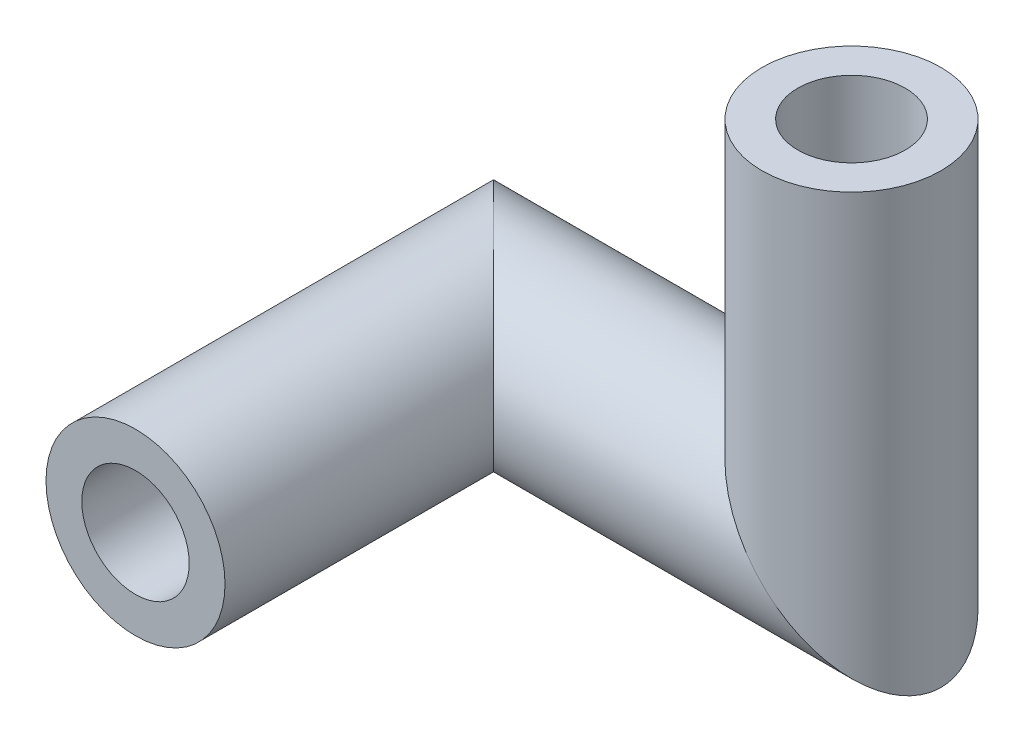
ISO-10303-21;
HEADER;
FILE_DESCRIPTION(('STEP AP214'),'2;1');
FILE_NAME('part.step','',(''),(''),'','','');
FILE_SCHEMA(('AUTOMOTIVE_DESIGN { 1 0 10303 214 1 1 1 1 }'));
ENDSEC;
DATA;
#1=APPLICATION_CONTEXT('core data for automotive mechanical design processes');
#2=APPLICATION_PROTOCOL_DEFINITION('international standard','automotive_design',2000,#1);
#3=PRODUCT_CONTEXT('',#1,'mechanical');
#4=PRODUCT('Part','Part','',(#3));
#5=PRODUCT_RELATED_PRODUCT_CATEGORY('part','',(#4));
#6=PRODUCT_DEFINITION_FORMATION('','',#4);
#7=PRODUCT_DEFINITION_CONTEXT('part definition',#1,'design');
#8=PRODUCT_DEFINITION('design','',#6,#7);
#9=PRODUCT_DEFINITION_SHAPE('','',#8);
#10=(LENGTH_UNIT() NAMED_UNIT(*) SI_UNIT(.MILLI.,.METRE.));
#11=(NAMED_UNIT(*) PLANE_ANGLE_UNIT() SI_UNIT($,.RADIAN.));
#12=(NAMED_UNIT(*) SI_UNIT($,.STERADIAN.) SOLID_ANGLE_UNIT());
#13=UNCERTAINTY_MEASURE_WITH_UNIT(LENGTH_MEASURE(1.E-05),#10,'distance_accuracy_value','');
#14=(GEOMETRIC_REPRESENTATION_CONTEXT(3) GLOBAL_UNCERTAINTY_ASSIGNED_CONTEXT((#13)) GLOBAL_UNIT_ASSIGNED_CONTEXT((#10,
#11,#12)) REPRESENTATION_CONTEXT('',''));
#15=CARTESIAN_POINT('',(0.,0.,0.));
#16=DIRECTION('',(0.,0.,1.));
#17=DIRECTION('',(1.,0.,0.));
#18=AXIS2_PLACEMENT_3D('',#15,#16,#17);
#19=CARTESIAN_POINT('',(10.,9.99999999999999,-10.));
#20=DIRECTION('',(0.,-1.,0.));
#21=DIRECTION('',(0.,0.,-1.));
#22=AXIS2_PLACEMENT_3D('',#19,#20,#21);
#23=PLANE('',#22);
#24=CARTESIAN_POINT('',(10.,9.99999999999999,-10.));
#25=DIRECTION('',(0.,-1.,0.));
#26=DIRECTION('',(0.,0.,-1.));
#27=AXIS2_PLACEMENT_3D('',#24,#25,#26);
#28=CIRCLE('',#27,1.5);
#29=CARTESIAN_POINT('',(10.,9.99999999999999,-11.5));
#30=VERTEX_POINT('',#29);
#31=EDGE_CURVE('E72',#30,#30,#28,.T.);
#32=ORIENTED_EDGE('',*,*,#31,.T.);
#33=EDGE_LOOP('',(#32));
#34=FACE_BOUND('',#33,.T.);
#35=CARTESIAN_POINT('',(10.,9.99999999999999,-10.));
#36=DIRECTION('',(0.,-1.,0.));
#37=DIRECTION('',(0.,0.,-1.));
#38=AXIS2_PLACEMENT_3D('',#35,#36,#37);
#39=CIRCLE('',#38,2.5);
#40=CARTESIAN_POINT('',(10.,9.99999999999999,-12.5));
#41=VERTEX_POINT('',#40);
#42=EDGE_CURVE('E44',#41,#41,#39,.T.);
#43=ORIENTED_EDGE('',*,*,#42,.F.);
#44=EDGE_LOOP('',(#43));
#45=FACE_BOUND('',#44,.T.);
#46=ADVANCED_FACE('F41',(#34,#45),#23,.F.);
#47=CARTESIAN_POINT('',(0.,0.,0.));
#48=DIRECTION('',(0.,0.,1.));
#49=DIRECTION('',(-1.,0.,0.));
#50=AXIS2_PLACEMENT_3D('',#47,#48,#49);
#51=PLANE('',#50);
#52=CARTESIAN_POINT('',(0.,0.,0.));
#53=DIRECTION('',(0.,0.,1.));
#54=DIRECTION('',(0.,-1.,0.));
#55=AXIS2_PLACEMENT_3D('',#52,#53,#54);
#56=CIRCLE('',#55,1.5);
#57=CARTESIAN_POINT('',(0.,-1.5,0.));
#58=VERTEX_POINT('',#57);
#59=EDGE_CURVE('E64',#58,#58,#56,.T.);
#60=ORIENTED_EDGE('',*,*,#59,.F.);
#61=EDGE_LOOP('',(#60));
#62=FACE_BOUND('',#61,.T.);
#63=CARTESIAN_POINT('',(0.,0.,0.));
#64=DIRECTION('',(0.,0.,1.));
#65=DIRECTION('',(-1.,0.,0.));
#66=AXIS2_PLACEMENT_3D('',#63,#64,#65);
#67=CIRCLE('',#66,2.5);
#68=CARTESIAN_POINT('',(-2.5,0.,0.));
#69=VERTEX_POINT('',#68);
#70=EDGE_CURVE('E48',#69,#69,#67,.T.);
#71=ORIENTED_EDGE('',*,*,#70,.T.);
#72=EDGE_LOOP('',(#71));
#73=FACE_BOUND('',#72,.T.);
#74=ADVANCED_FACE('F104',(#62,#73),#51,.T.);
#75=CARTESIAN_POINT('',(9.99999999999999,-5.6,-10.));
#76=DIRECTION('',(0.,1.,0.));
#77=DIRECTION('',(0.,0.,1.));
#78=AXIS2_PLACEMENT_3D('',#75,#76,#77);
#79=CYLINDRICAL_SURFACE('',#78,2.5);
#80=CARTESIAN_POINT('',(10.,0.,-10.));
#81=DIRECTION('',(0.707106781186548,0.707106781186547,0.));
#82=DIRECTION('',(0.707106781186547,-0.707106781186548,0.));
#83=AXIS2_PLACEMENT_3D('',#80,#81,#82);
#84=ELLIPSE('',#83,3.53553390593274,2.5);
#85=CARTESIAN_POINT('',(12.5,-2.5,-10.));
#86=VERTEX_POINT('',#85);
#87=EDGE_CURVE('E53',#86,#86,#84,.T.);
#88=ORIENTED_EDGE('',*,*,#87,.T.);
#89=EDGE_LOOP('',(#88));
#90=FACE_BOUND('',#89,.T.);
#91=ORIENTED_EDGE('',*,*,#42,.T.);
#92=EDGE_LOOP('',(#91));
#93=FACE_BOUND('',#92,.T.);
#94=ADVANCED_FACE('F102',(#90,#93),#79,.T.);
#95=CARTESIAN_POINT('',(-2.85,0.,-9.99999999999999));
#96=DIRECTION('',(1.,0.,0.));
#97=DIRECTION('',(0.,0.,-1.));
#98=AXIS2_PLACEMENT_3D('',#95,#96,#97);
#99=CYLINDRICAL_SURFACE('',#98,2.5);
#100=CARTESIAN_POINT('',(0.,0.,-9.99999999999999));
#101=DIRECTION('',(0.707106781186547,0.,-0.707106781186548));
#102=DIRECTION('',(-0.707106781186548,0.,-0.707106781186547));
#103=AXIS2_PLACEMENT_3D('',#100,#101,#102);
#104=ELLIPSE('',#103,3.53553390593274,2.5);
#105=CARTESIAN_POINT('',(-2.5,0.,-12.5));
#106=VERTEX_POINT('',#105);
#107=EDGE_CURVE('E11',#106,#106,#104,.T.);
#108=ORIENTED_EDGE('',*,*,#107,.T.);
#109=EDGE_LOOP('',(#108));
#110=FACE_BOUND('',#109,.T.);
#111=ORIENTED_EDGE('',*,*,#87,.F.);
#112=EDGE_LOOP('',(#111));
#113=FACE_BOUND('',#112,.T.);
#114=ADVANCED_FACE('F93',(#110,#113),#99,.T.);
#115=CARTESIAN_POINT('',(0.,0.,0.));
#116=DIRECTION('',(0.,0.,-1.));
#117=DIRECTION('',(-1.,0.,0.));
#118=AXIS2_PLACEMENT_3D('',#115,#116,#117);
#119=CYLINDRICAL_SURFACE('',#118,2.5);
#120=ORIENTED_EDGE('',*,*,#70,.F.);
#121=EDGE_LOOP('',(#120));
#122=FACE_BOUND('',#121,.T.);
#123=ORIENTED_EDGE('',*,*,#107,.F.);
#124=EDGE_LOOP('',(#123));
#125=FACE_BOUND('',#124,.T.);
#126=ADVANCED_FACE('F84',(#122,#125),#119,.T.);
#127=CARTESIAN_POINT('',(9.99999999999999,-5.6,-10.));
#128=DIRECTION('',(0.,1.,0.));
#129=DIRECTION('',(0.,0.,1.));
#130=AXIS2_PLACEMENT_3D('',#127,#128,#129);
#131=CYLINDRICAL_SURFACE('',#130,1.5);
#132=CARTESIAN_POINT('',(9.99999999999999,0.,-10.));
#133=DIRECTION('',(0.707106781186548,0.707106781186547,0.));
#134=DIRECTION('',(-0.707106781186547,0.707106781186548,0.));
#135=AXIS2_PLACEMENT_3D('',#132,#133,#134);
#136=ELLIPSE('',#135,2.12132034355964,1.5);
#137=CARTESIAN_POINT('',(8.49999999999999,1.5,-10.));
#138=VERTEX_POINT('',#137);
#139=EDGE_CURVE('E69',#138,#138,#136,.T.);
#140=ORIENTED_EDGE('',*,*,#139,.F.);
#141=EDGE_LOOP('',(#140));
#142=FACE_BOUND('',#141,.T.);
#143=ORIENTED_EDGE('',*,*,#31,.F.);
#144=EDGE_LOOP('',(#143));
#145=FACE_BOUND('',#144,.T.);
#146=ADVANCED_FACE('F81',(#142,#145),#131,.F.);
#147=CARTESIAN_POINT('',(-2.85,0.,-9.99999999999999));
#148=DIRECTION('',(1.,0.,0.));
#149=DIRECTION('',(0.,0.,-1.));
#150=AXIS2_PLACEMENT_3D('',#147,#148,#149);
#151=CYLINDRICAL_SURFACE('',#150,1.5);
#152=CARTESIAN_POINT('',(0.,0.,-9.99999999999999));
#153=DIRECTION('',(0.707106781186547,0.,-0.707106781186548));
#154=DIRECTION('',(0.707106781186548,0.,0.707106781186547));
#155=AXIS2_PLACEMENT_3D('',#152,#153,#154);
#156=ELLIPSE('',#155,2.12132034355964,1.5);
#157=CARTESIAN_POINT('',(1.5,0.,-8.49999999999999));
#158=VERTEX_POINT('',#157);
#159=EDGE_CURVE('E60',#158,#158,#156,.T.);
#160=ORIENTED_EDGE('',*,*,#159,.F.);
#161=EDGE_LOOP('',(#160));
#162=FACE_BOUND('',#161,.T.);
#163=ORIENTED_EDGE('',*,*,#139,.T.);
#164=EDGE_LOOP('',(#163));
#165=FACE_BOUND('',#164,.T.);
#166=ADVANCED_FACE('F79',(#162,#165),#151,.F.);
#167=CARTESIAN_POINT('',(0.,0.,0.));
#168=DIRECTION('',(0.,0.,-1.));
#169=DIRECTION('',(-1.,0.,0.));
#170=AXIS2_PLACEMENT_3D('',#167,#168,#169);
#171=CYLINDRICAL_SURFACE('',#170,1.5);
#172=ORIENTED_EDGE('',*,*,#59,.T.);
#173=EDGE_LOOP('',(#172));
#174=FACE_BOUND('',#173,.T.);
#175=ORIENTED_EDGE('',*,*,#159,.T.);
#176=EDGE_LOOP('',(#175));
#177=FACE_BOUND('',#176,.T.);
#178=ADVANCED_FACE('F90',(#174,#177),#171,.F.);
#179=CLOSED_SHELL('',(#46,#74,#94,#114,#126,#146,#166,#178));
#180=MANIFOLD_SOLID_BREP('B2',#179);
#181=ADVANCED_BREP_SHAPE_REPRESENTATION('',(#18,#180),#14);
#182=SHAPE_DEFINITION_REPRESENTATION(#9,#181);
ENDSEC;
END-ISO-10303-21;
